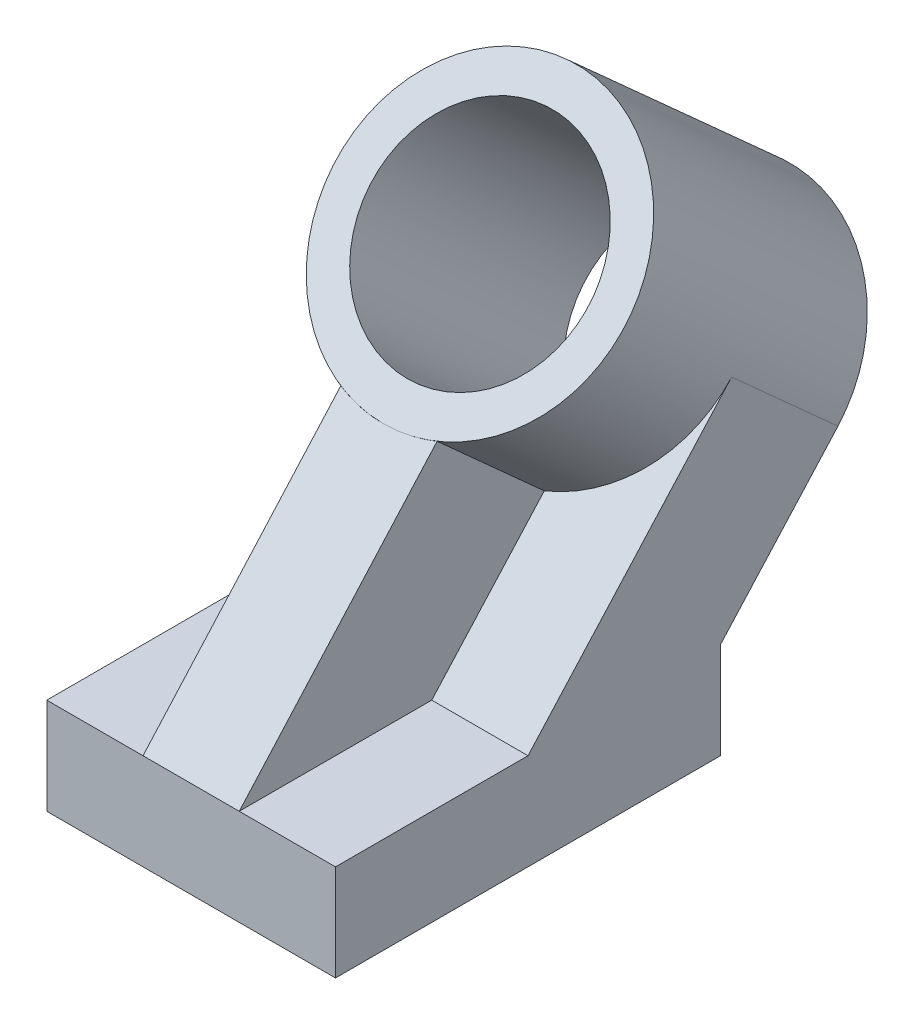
ISO-10303-21;
HEADER;
FILE_DESCRIPTION(('STEP AP214'),'2;1');
FILE_NAME('part.step','',(''),(''),'','','');
FILE_SCHEMA(('AUTOMOTIVE_DESIGN { 1 0 10303 214 1 1 1 1 }'));
ENDSEC;
DATA;
#1=APPLICATION_CONTEXT('core data for automotive mechanical design processes');
#2=APPLICATION_PROTOCOL_DEFINITION('international standard','automotive_design',2000,#1);
#3=PRODUCT_CONTEXT('',#1,'mechanical');
#4=PRODUCT('Part','Part','',(#3));
#5=PRODUCT_RELATED_PRODUCT_CATEGORY('part','',(#4));
#6=PRODUCT_DEFINITION_FORMATION('','',#4);
#7=PRODUCT_DEFINITION_CONTEXT('part definition',#1,'design');
#8=PRODUCT_DEFINITION('design','',#6,#7);
#9=PRODUCT_DEFINITION_SHAPE('','',#8);
#10=(LENGTH_UNIT() NAMED_UNIT(*) SI_UNIT(.MILLI.,.METRE.));
#11=(NAMED_UNIT(*) PLANE_ANGLE_UNIT() SI_UNIT($,.RADIAN.));
#12=(NAMED_UNIT(*) SI_UNIT($,.STERADIAN.) SOLID_ANGLE_UNIT());
#13=UNCERTAINTY_MEASURE_WITH_UNIT(LENGTH_MEASURE(1.E-05),#10,'distance_accuracy_value','');
#14=(GEOMETRIC_REPRESENTATION_CONTEXT(3) GLOBAL_UNCERTAINTY_ASSIGNED_CONTEXT((#13)) GLOBAL_UNIT_ASSIGNED_CONTEXT((#10,
#11,#12)) REPRESENTATION_CONTEXT('',''));
#15=CARTESIAN_POINT('',(0.,0.,0.));
#16=DIRECTION('',(0.,0.,1.));
#17=DIRECTION('',(1.,0.,0.));
#18=AXIS2_PLACEMENT_3D('',#15,#16,#17);
#19=CARTESIAN_POINT('',(38.1,25.4,0.));
#20=DIRECTION('',(0.,-0.669130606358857,-0.743144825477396));
#21=DIRECTION('',(0.,0.743144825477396,-0.669130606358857));
#22=AXIS2_PLACEMENT_3D('',#19,#20,#21);
#23=PLANE('',#22);
#24=DIRECTION('',(0.,-0.743144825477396,0.669130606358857));
#25=VECTOR('',#24,1.);
#26=CARTESIAN_POINT('',(-12.7,25.4,0.));
#27=LINE('',#26,#25);
#28=CARTESIAN_POINT('',(-12.7,58.3860739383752,-29.7007943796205));
#29=VERTEX_POINT('',#28);
#30=CARTESIAN_POINT('',(-12.7,25.4,0.));
#31=VERTEX_POINT('',#30);
#32=EDGE_CURVE('E140',#29,#31,#27,.T.);
#33=ORIENTED_EDGE('',*,*,#32,.F.);
#34=CARTESIAN_POINT('',(0.,85.0805974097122,-53.7366512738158));
#35=DIRECTION('',(0.,0.669130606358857,0.743144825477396));
#36=DIRECTION('',(0.,-0.743144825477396,0.669130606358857));
#37=AXIS2_PLACEMENT_3D('',#34,#35,#36);
#38=CIRCLE('',#37,38.1);
#39=CARTESIAN_POINT('',(-38.1,85.0805974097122,-53.7366512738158));
#40=VERTEX_POINT('',#39);
#41=EDGE_CURVE('E185',#40,#29,#38,.T.);
#42=ORIENTED_EDGE('',*,*,#41,.F.);
#43=DIRECTION('',(0.,-0.743144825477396,0.669130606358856));
#44=VECTOR('',#43,1.);
#45=CARTESIAN_POINT('',(-38.1,25.4,0.));
#46=LINE('',#45,#44);
#47=CARTESIAN_POINT('',(-38.1,25.4,0.));
#48=VERTEX_POINT('',#47);
#49=EDGE_CURVE('E213',#40,#48,#46,.T.);
#50=ORIENTED_EDGE('',*,*,#49,.T.);
#51=DIRECTION('',(-1.,0.,0.));
#52=VECTOR('',#51,1.);
#53=CARTESIAN_POINT('',(38.1,25.4,0.));
#54=LINE('',#53,#52);
#55=EDGE_CURVE('E217',#31,#48,#54,.T.);
#56=ORIENTED_EDGE('',*,*,#55,.F.);
#57=EDGE_LOOP('',(#33,#42,#50,#56));
#58=FACE_BOUND('',#57,.T.);
#59=ADVANCED_FACE('F55',(#58),#23,.F.);
#60=CARTESIAN_POINT('',(38.1,25.4,50.8));
#61=DIRECTION('',(0.,-1.,0.));
#62=DIRECTION('',(0.,0.,-1.));
#63=AXIS2_PLACEMENT_3D('',#60,#61,#62);
#64=PLANE('',#63);
#65=DIRECTION('',(0.,0.,1.));
#66=VECTOR('',#65,1.);
#67=CARTESIAN_POINT('',(-12.7,25.4,50.8));
#68=LINE('',#67,#66);
#69=CARTESIAN_POINT('',(-12.7,25.4,50.8));
#70=VERTEX_POINT('',#69);
#71=EDGE_CURVE('E137',#31,#70,#68,.T.);
#72=ORIENTED_EDGE('',*,*,#71,.F.);
#73=ORIENTED_EDGE('',*,*,#55,.T.);
#74=DIRECTION('',(0.,0.,1.));
#75=VECTOR('',#74,1.);
#76=CARTESIAN_POINT('',(-38.1,25.4,50.8));
#77=LINE('',#76,#75);
#78=CARTESIAN_POINT('',(-38.1,25.4,50.8));
#79=VERTEX_POINT('',#78);
#80=EDGE_CURVE('E160',#48,#79,#77,.T.);
#81=ORIENTED_EDGE('',*,*,#80,.T.);
#82=DIRECTION('',(-1.,0.,0.));
#83=VECTOR('',#82,1.);
#84=CARTESIAN_POINT('',(38.1,25.4,50.8));
#85=LINE('',#84,#83);
#86=EDGE_CURVE('E157',#70,#79,#85,.T.);
#87=ORIENTED_EDGE('',*,*,#86,.F.);
#88=EDGE_LOOP('',(#72,#73,#81,#87));
#89=FACE_BOUND('',#88,.T.);
#90=ADVANCED_FACE('F158',(#89),#64,.F.);
#91=CARTESIAN_POINT('',(12.7,58.3860739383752,-29.7007943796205));
#92=VERTEX_POINT('',#91);
#93=CARTESIAN_POINT('',(38.1,85.0805974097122,-53.7366512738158));
#94=VERTEX_POINT('',#93);
#95=EDGE_CURVE('E181',#92,#94,#38,.T.);
#96=ORIENTED_EDGE('',*,*,#95,.F.);
#97=DIRECTION('',(0.,-0.743144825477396,0.669130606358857));
#98=VECTOR('',#97,1.);
#99=CARTESIAN_POINT('',(12.7,25.4,0.));
#100=LINE('',#99,#98);
#101=CARTESIAN_POINT('',(12.7,25.4,0.));
#102=VERTEX_POINT('',#101);
#103=EDGE_CURVE('E239',#92,#102,#100,.T.);
#104=ORIENTED_EDGE('',*,*,#103,.T.);
#105=CARTESIAN_POINT('',(38.1,25.4,0.));
#106=VERTEX_POINT('',#105);
#107=EDGE_CURVE('E218',#106,#102,#54,.T.);
#108=ORIENTED_EDGE('',*,*,#107,.F.);
#109=DIRECTION('',(0.,-0.743144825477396,0.669130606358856));
#110=VECTOR('',#109,1.);
#111=CARTESIAN_POINT('',(38.1,25.4,0.));
#112=LINE('',#111,#110);
#113=EDGE_CURVE('E200',#94,#106,#112,.T.);
#114=ORIENTED_EDGE('',*,*,#113,.F.);
#115=EDGE_LOOP('',(#96,#104,#108,#114));
#116=FACE_BOUND('',#115,.T.);
#117=ADVANCED_FACE('F248',(#116),#23,.F.);
#118=CARTESIAN_POINT('',(38.1,25.4,-50.8));
#119=DIRECTION('',(0.,0.669130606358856,0.743144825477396));
#120=DIRECTION('',(0.,-0.743144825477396,0.669130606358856));
#121=AXIS2_PLACEMENT_3D('',#118,#119,#120);
#122=PLANE('',#121);
#123=CARTESIAN_POINT('',(0.,59.8197412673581,-81.7916742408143));
#124=DIRECTION('',(0.,0.669130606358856,0.743144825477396));
#125=DIRECTION('',(0.,-0.743144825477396,0.669130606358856));
#126=AXIS2_PLACEMENT_3D('',#123,#124,#125);
#127=CIRCLE('',#126,28.575);
#128=CARTESIAN_POINT('',(0.,38.5843778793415,-62.67126716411));
#129=VERTEX_POINT('',#128);
#130=EDGE_CURVE('E173',#129,#129,#127,.F.);
#131=ORIENTED_EDGE('',*,*,#130,.F.);
#132=EDGE_LOOP('',(#131));
#133=FACE_BOUND('',#132,.T.);
#134=DIRECTION('',(-1.,0.,0.));
#135=VECTOR('',#134,1.);
#136=CARTESIAN_POINT('',(38.1,25.4,-50.8));
#137=LINE('',#136,#135);
#138=CARTESIAN_POINT('',(38.1,25.4,-50.8));
#139=VERTEX_POINT('',#138);
#140=CARTESIAN_POINT('',(-38.1,25.4,-50.8));
#141=VERTEX_POINT('',#140);
#142=EDGE_CURVE('E221',#139,#141,#137,.T.);
#143=ORIENTED_EDGE('',*,*,#142,.T.);
#144=DIRECTION('',(0.,0.743144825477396,-0.669130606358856));
#145=VECTOR('',#144,1.);
#146=CARTESIAN_POINT('',(-38.1,25.4,-50.8));
#147=LINE('',#146,#145);
#148=CARTESIAN_POINT('',(-38.1,59.8197412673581,-81.7916742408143));
#149=VERTEX_POINT('',#148);
#150=EDGE_CURVE('E210',#141,#149,#147,.T.);
#151=ORIENTED_EDGE('',*,*,#150,.T.);
#152=CARTESIAN_POINT('',(0.,59.8197412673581,-81.7916742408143));
#153=DIRECTION('',(0.,0.669130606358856,0.743144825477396));
#154=DIRECTION('',(0.,-0.743144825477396,0.669130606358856));
#155=AXIS2_PLACEMENT_3D('',#152,#153,#154);
#156=CIRCLE('',#155,38.1);
#157=CARTESIAN_POINT('',(38.1,59.8197412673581,-81.7916742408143));
#158=VERTEX_POINT('',#157);
#159=EDGE_CURVE('E78',#158,#149,#156,.T.);
#160=ORIENTED_EDGE('',*,*,#159,.F.);
#161=DIRECTION('',(0.,0.743144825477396,-0.669130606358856));
#162=VECTOR('',#161,1.);
#163=CARTESIAN_POINT('',(38.1,25.4,-50.8));
#164=LINE('',#163,#162);
#165=EDGE_CURVE('E197',#139,#158,#164,.T.);
#166=ORIENTED_EDGE('',*,*,#165,.F.);
#167=EDGE_LOOP('',(#143,#151,#160,#166));
#168=FACE_BOUND('',#167,.T.);
#169=ADVANCED_FACE('F257',(#133,#168),#122,.F.);
#170=CARTESIAN_POINT('',(38.1,0.,50.8));
#171=DIRECTION('',(0.,0.,-1.));
#172=DIRECTION('',(-1.,0.,0.));
#173=AXIS2_PLACEMENT_3D('',#170,#171,#172);
#174=PLANE('',#173);
#175=CARTESIAN_POINT('',(38.1,25.4,50.8));
#176=VERTEX_POINT('',#175);
#177=CARTESIAN_POINT('',(12.7,25.4,50.8));
#178=VERTEX_POINT('',#177);
#179=EDGE_CURVE('E164',#176,#178,#85,.T.);
#180=ORIENTED_EDGE('',*,*,#179,.T.);
#181=DIRECTION('',(-1.,0.,0.));
#182=VECTOR('',#181,1.);
#183=CARTESIAN_POINT('',(38.1,25.4,50.8));
#184=LINE('',#183,#182);
#185=EDGE_CURVE('E150',#178,#70,#184,.T.);
#186=ORIENTED_EDGE('',*,*,#185,.T.);
#187=ORIENTED_EDGE('',*,*,#86,.T.);
#188=DIRECTION('',(0.,-1.,0.));
#189=VECTOR('',#188,1.);
#190=CARTESIAN_POINT('',(-38.1,0.,50.8));
#191=LINE('',#190,#189);
#192=CARTESIAN_POINT('',(-38.1,0.,50.8));
#193=VERTEX_POINT('',#192);
#194=EDGE_CURVE('E189',#79,#193,#191,.T.);
#195=ORIENTED_EDGE('',*,*,#194,.T.);
#196=DIRECTION('',(-1.,0.,0.));
#197=VECTOR('',#196,1.);
#198=CARTESIAN_POINT('',(38.1,0.,50.8));
#199=LINE('',#198,#197);
#200=CARTESIAN_POINT('',(38.1,0.,50.8));
#201=VERTEX_POINT('',#200);
#202=EDGE_CURVE('E225',#201,#193,#199,.T.);
#203=ORIENTED_EDGE('',*,*,#202,.F.);
#204=DIRECTION('',(0.,-1.,0.));
#205=VECTOR('',#204,1.);
#206=CARTESIAN_POINT('',(38.1,0.,50.8));
#207=LINE('',#206,#205);
#208=EDGE_CURVE('E190',#176,#201,#207,.T.);
#209=ORIENTED_EDGE('',*,*,#208,.F.);
#210=EDGE_LOOP('',(#180,#186,#187,#195,#203,#209));
#211=FACE_BOUND('',#210,.T.);
#212=ADVANCED_FACE('F57',(#211),#174,.F.);
#213=CARTESIAN_POINT('',(38.1,0.,50.8));
#214=DIRECTION('',(0.,1.,0.));
#215=DIRECTION('',(0.,0.,1.));
#216=AXIS2_PLACEMENT_3D('',#213,#214,#215);
#217=PLANE('',#216);
#218=ORIENTED_EDGE('',*,*,#202,.T.);
#219=DIRECTION('',(0.,0.,-1.));
#220=VECTOR('',#219,1.);
#221=CARTESIAN_POINT('',(-38.1,0.,50.8));
#222=LINE('',#221,#220);
#223=CARTESIAN_POINT('',(-38.1,0.,-50.8));
#224=VERTEX_POINT('',#223);
#225=EDGE_CURVE('E204',#193,#224,#222,.T.);
#226=ORIENTED_EDGE('',*,*,#225,.T.);
#227=DIRECTION('',(-1.,0.,0.));
#228=VECTOR('',#227,1.);
#229=CARTESIAN_POINT('',(38.1,0.,-50.8));
#230=LINE('',#229,#228);
#231=CARTESIAN_POINT('',(38.1,0.,-50.8));
#232=VERTEX_POINT('',#231);
#233=EDGE_CURVE('E223',#232,#224,#230,.T.);
#234=ORIENTED_EDGE('',*,*,#233,.F.);
#235=DIRECTION('',(0.,0.,-1.));
#236=VECTOR('',#235,1.);
#237=CARTESIAN_POINT('',(38.1,0.,50.8));
#238=LINE('',#237,#236);
#239=EDGE_CURVE('E193',#201,#232,#238,.T.);
#240=ORIENTED_EDGE('',*,*,#239,.F.);
#241=EDGE_LOOP('',(#218,#226,#234,#240));
#242=FACE_BOUND('',#241,.T.);
#243=ADVANCED_FACE('F265',(#242),#217,.F.);
#244=CARTESIAN_POINT('',(38.1,0.,-50.8));
#245=DIRECTION('',(0.,0.,1.));
#246=DIRECTION('',(1.,0.,0.));
#247=AXIS2_PLACEMENT_3D('',#244,#245,#246);
#248=PLANE('',#247);
#249=ORIENTED_EDGE('',*,*,#233,.T.);
#250=DIRECTION('',(0.,1.,0.));
#251=VECTOR('',#250,1.);
#252=CARTESIAN_POINT('',(-38.1,0.,-50.8));
#253=LINE('',#252,#251);
#254=EDGE_CURVE('E207',#224,#141,#253,.T.);
#255=ORIENTED_EDGE('',*,*,#254,.T.);
#256=ORIENTED_EDGE('',*,*,#142,.F.);
#257=DIRECTION('',(0.,1.,0.));
#258=VECTOR('',#257,1.);
#259=CARTESIAN_POINT('',(38.1,0.,-50.8));
#260=LINE('',#259,#258);
#261=EDGE_CURVE('E195',#232,#139,#260,.T.);
#262=ORIENTED_EDGE('',*,*,#261,.F.);
#263=EDGE_LOOP('',(#249,#255,#256,#262));
#264=FACE_BOUND('',#263,.T.);
#265=ADVANCED_FACE('F262',(#264),#248,.F.);
#266=ORIENTED_EDGE('',*,*,#107,.T.);
#267=DIRECTION('',(0.,0.,1.));
#268=VECTOR('',#267,1.);
#269=CARTESIAN_POINT('',(12.7,25.4,50.8));
#270=LINE('',#269,#268);
#271=EDGE_CURVE('E234',#102,#178,#270,.T.);
#272=ORIENTED_EDGE('',*,*,#271,.T.);
#273=ORIENTED_EDGE('',*,*,#179,.F.);
#274=DIRECTION('',(0.,0.,1.));
#275=VECTOR('',#274,1.);
#276=CARTESIAN_POINT('',(38.1,25.4,50.8));
#277=LINE('',#276,#275);
#278=EDGE_CURVE('E165',#106,#176,#277,.T.);
#279=ORIENTED_EDGE('',*,*,#278,.F.);
#280=EDGE_LOOP('',(#266,#272,#273,#279));
#281=FACE_BOUND('',#280,.T.);
#282=ADVANCED_FACE('F272',(#281),#64,.F.);
#283=CARTESIAN_POINT('',(38.1,0.,0.));
#284=DIRECTION('',(-1.,0.,0.));
#285=DIRECTION('',(0.,0.,1.));
#286=AXIS2_PLACEMENT_3D('',#283,#284,#285);
#287=PLANE('',#286);
#288=ORIENTED_EDGE('',*,*,#165,.T.);
#289=DIRECTION('',(0.,0.669130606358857,0.743144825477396));
#290=VECTOR('',#289,1.);
#291=CARTESIAN_POINT('',(38.1,59.5867213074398,-82.0504691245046));
#292=LINE('',#291,#290);
#293=EDGE_CURVE('E12',#158,#94,#292,.T.);
#294=ORIENTED_EDGE('',*,*,#293,.T.);
#295=ORIENTED_EDGE('',*,*,#113,.T.);
#296=ORIENTED_EDGE('',*,*,#278,.T.);
#297=ORIENTED_EDGE('',*,*,#208,.T.);
#298=ORIENTED_EDGE('',*,*,#239,.T.);
#299=ORIENTED_EDGE('',*,*,#261,.T.);
#300=EDGE_LOOP('',(#288,#294,#295,#296,#297,#298,#299));
#301=FACE_BOUND('',#300,.T.);
#302=ADVANCED_FACE('F252',(#301),#287,.F.);
#303=CARTESIAN_POINT('',(-38.1,0.,0.));
#304=DIRECTION('',(-1.,0.,0.));
#305=DIRECTION('',(0.,0.,1.));
#306=AXIS2_PLACEMENT_3D('',#303,#304,#305);
#307=PLANE('',#306);
#308=DIRECTION('',(0.,0.669130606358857,0.743144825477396));
#309=VECTOR('',#308,1.);
#310=CARTESIAN_POINT('',(-38.1,59.5867213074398,-82.0504691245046));
#311=LINE('',#310,#309);
#312=EDGE_CURVE('E63',#149,#40,#311,.T.);
#313=ORIENTED_EDGE('',*,*,#312,.F.);
#314=ORIENTED_EDGE('',*,*,#150,.F.);
#315=ORIENTED_EDGE('',*,*,#254,.F.);
#316=ORIENTED_EDGE('',*,*,#225,.F.);
#317=ORIENTED_EDGE('',*,*,#194,.F.);
#318=ORIENTED_EDGE('',*,*,#80,.F.);
#319=ORIENTED_EDGE('',*,*,#49,.F.);
#320=EDGE_LOOP('',(#313,#314,#315,#316,#317,#318,#319));
#321=FACE_BOUND('',#320,.T.);
#322=ADVANCED_FACE('F259',(#321),#307,.T.);
#323=CARTESIAN_POINT('',(0.,59.5867213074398,-82.0504691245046));
#324=DIRECTION('',(0.,0.669130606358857,0.743144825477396));
#325=DIRECTION('',(0.,-0.743144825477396,0.669130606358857));
#326=AXIS2_PLACEMENT_3D('',#323,#324,#325);
#327=CYLINDRICAL_SURFACE('',#326,38.1);
#328=ORIENTED_EDGE('',*,*,#159,.T.);
#329=ORIENTED_EDGE('',*,*,#312,.T.);
#330=ORIENTED_EDGE('',*,*,#41,.T.);
#331=DIRECTION('',(0.,0.669130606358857,0.743144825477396));
#332=VECTOR('',#331,1.);
#333=CARTESIAN_POINT('',(-12.7,32.8921978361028,-58.0146122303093));
#334=LINE('',#333,#332);
#335=CARTESIAN_POINT('',(-12.7,83.859981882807,-1.40915341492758));
#336=VERTEX_POINT('',#335);
#337=EDGE_CURVE('E232',#29,#336,#334,.T.);
#338=ORIENTED_EDGE('',*,*,#337,.T.);
#339=CARTESIAN_POINT('',(0.,110.652146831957,-25.336568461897));
#340=DIRECTION('',(0.,0.66610621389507,0.74585689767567));
#341=DIRECTION('',(0.,0.74585689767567,-0.66610621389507));
#342=AXIS2_PLACEMENT_3D('',#339,#340,#341);
#343=ELLIPSE('',#342,38.1003143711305,38.1);
#344=CARTESIAN_POINT('',(12.7,83.859981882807,-1.40915341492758));
#345=VERTEX_POINT('',#344);
#346=EDGE_CURVE('E153',#345,#336,#343,.F.);
#347=ORIENTED_EDGE('',*,*,#346,.F.);
#348=DIRECTION('',(0.,0.669130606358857,0.743144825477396));
#349=VECTOR('',#348,1.);
#350=CARTESIAN_POINT('',(12.7,32.8921978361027,-58.0146122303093));
#351=LINE('',#350,#349);
#352=EDGE_CURVE('E175',#92,#345,#351,.T.);
#353=ORIENTED_EDGE('',*,*,#352,.F.);
#354=ORIENTED_EDGE('',*,*,#95,.T.);
#355=ORIENTED_EDGE('',*,*,#293,.F.);
#356=EDGE_LOOP('',(#328,#329,#330,#338,#347,#353,#354,#355));
#357=FACE_BOUND('',#356,.T.);
#358=CARTESIAN_POINT('',(0.,110.574473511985,-25.422833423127));
#359=DIRECTION('',(0.,0.669130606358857,0.743144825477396));
#360=DIRECTION('',(0.,-0.743144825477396,0.669130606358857));
#361=AXIS2_PLACEMENT_3D('',#358,#359,#360);
#362=CIRCLE('',#361,38.1);
#363=CARTESIAN_POINT('',(0.,82.2606556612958,0.0710426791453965));
#364=VERTEX_POINT('',#363);
#365=EDGE_CURVE('E182',#364,#364,#362,.T.);
#366=ORIENTED_EDGE('',*,*,#365,.F.);
#367=EDGE_LOOP('',(#366));
#368=FACE_BOUND('',#367,.T.);
#369=ADVANCED_FACE('F227',(#357,#368),#327,.T.);
#370=CARTESIAN_POINT('',(0.,110.574473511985,-25.422833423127));
#371=DIRECTION('',(0.,0.669130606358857,0.743144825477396));
#372=DIRECTION('',(0.,-0.743144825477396,0.669130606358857));
#373=AXIS2_PLACEMENT_3D('',#370,#371,#372);
#374=PLANE('',#373);
#375=CARTESIAN_POINT('',(0.,110.574473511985,-25.4228334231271));
#376=DIRECTION('',(0.,0.669130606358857,0.743144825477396));
#377=DIRECTION('',(0.,-0.743144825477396,0.669130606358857));
#378=AXIS2_PLACEMENT_3D('',#375,#376,#377);
#379=CIRCLE('',#378,28.575);
#380=CARTESIAN_POINT('',(0.,89.339110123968,-6.30242634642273));
#381=VERTEX_POINT('',#380);
#382=EDGE_CURVE('E170',#381,#381,#379,.T.);
#383=ORIENTED_EDGE('',*,*,#382,.F.);
#384=EDGE_LOOP('',(#383));
#385=FACE_BOUND('',#384,.T.);
#386=ORIENTED_EDGE('',*,*,#365,.T.);
#387=EDGE_LOOP('',(#386));
#388=FACE_BOUND('',#387,.T.);
#389=ADVANCED_FACE('F293',(#385,#388),#374,.T.);
#390=CARTESIAN_POINT('',(0.,20.3582494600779,-125.618100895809));
#391=DIRECTION('',(0.,0.669130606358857,0.743144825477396));
#392=DIRECTION('',(0.,-0.743144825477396,0.669130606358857));
#393=AXIS2_PLACEMENT_3D('',#390,#391,#392);
#394=CYLINDRICAL_SURFACE('',#393,28.575);
#395=ORIENTED_EDGE('',*,*,#130,.T.);
#396=EDGE_LOOP('',(#395));
#397=FACE_BOUND('',#396,.T.);
#398=ORIENTED_EDGE('',*,*,#382,.T.);
#399=EDGE_LOOP('',(#398));
#400=FACE_BOUND('',#399,.T.);
#401=ADVANCED_FACE('F290',(#397,#400),#394,.F.);
#402=CARTESIAN_POINT('',(0.,89.339110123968,-6.30242634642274));
#403=DIRECTION('',(0.,0.66610621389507,0.74585689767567));
#404=DIRECTION('',(0.,-0.74585689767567,0.66610621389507));
#405=AXIS2_PLACEMENT_3D('',#402,#403,#404);
#406=PLANE('',#405);
#407=ORIENTED_EDGE('',*,*,#185,.F.);
#408=DIRECTION('',(0.,-0.74585689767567,0.66610621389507));
#409=VECTOR('',#408,1.);
#410=CARTESIAN_POINT('',(12.7,89.339110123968,-6.30242634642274));
#411=LINE('',#410,#409);
#412=EDGE_CURVE('E144',#345,#178,#411,.T.);
#413=ORIENTED_EDGE('',*,*,#412,.F.);
#414=ORIENTED_EDGE('',*,*,#346,.T.);
#415=DIRECTION('',(0.,-0.74585689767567,0.66610621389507));
#416=VECTOR('',#415,1.);
#417=CARTESIAN_POINT('',(-12.7,89.339110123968,-6.30242634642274));
#418=LINE('',#417,#416);
#419=EDGE_CURVE('E70',#336,#70,#418,.T.);
#420=ORIENTED_EDGE('',*,*,#419,.T.);
#421=EDGE_LOOP('',(#407,#413,#414,#420));
#422=FACE_BOUND('',#421,.T.);
#423=ADVANCED_FACE('F147',(#422),#406,.T.);
#424=CARTESIAN_POINT('',(12.7,69.4441456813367,-28.2427751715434));
#425=DIRECTION('',(1.,0.,0.));
#426=DIRECTION('',(0.,0.,-1.));
#427=AXIS2_PLACEMENT_3D('',#424,#425,#426);
#428=PLANE('',#427);
#429=ORIENTED_EDGE('',*,*,#103,.F.);
#430=ORIENTED_EDGE('',*,*,#352,.T.);
#431=ORIENTED_EDGE('',*,*,#412,.T.);
#432=ORIENTED_EDGE('',*,*,#271,.F.);
#433=EDGE_LOOP('',(#429,#430,#431,#432));
#434=FACE_BOUND('',#433,.T.);
#435=ADVANCED_FACE('F243',(#434),#428,.T.);
#436=CARTESIAN_POINT('',(-12.7,69.4441456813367,-28.2427751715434));
#437=DIRECTION('',(1.,0.,0.));
#438=DIRECTION('',(0.,0.,-1.));
#439=AXIS2_PLACEMENT_3D('',#436,#437,#438);
#440=PLANE('',#439);
#441=ORIENTED_EDGE('',*,*,#337,.F.);
#442=ORIENTED_EDGE('',*,*,#32,.T.);
#443=ORIENTED_EDGE('',*,*,#71,.T.);
#444=ORIENTED_EDGE('',*,*,#419,.F.);
#445=EDGE_LOOP('',(#441,#442,#443,#444));
#446=FACE_BOUND('',#445,.T.);
#447=ADVANCED_FACE('F138',(#446),#440,.F.);
#448=CLOSED_SHELL('',(#59,#90,#117,#169,#212,#243,#265,#282,#302,#322,#369,#389,#401,#423,#435,#447));
#449=MANIFOLD_SOLID_BREP('B2',#448);
#450=ADVANCED_BREP_SHAPE_REPRESENTATION('',(#18,#449),#14);
#451=SHAPE_DEFINITION_REPRESENTATION(#9,#450);
ENDSEC;
END-ISO-10303-21;
